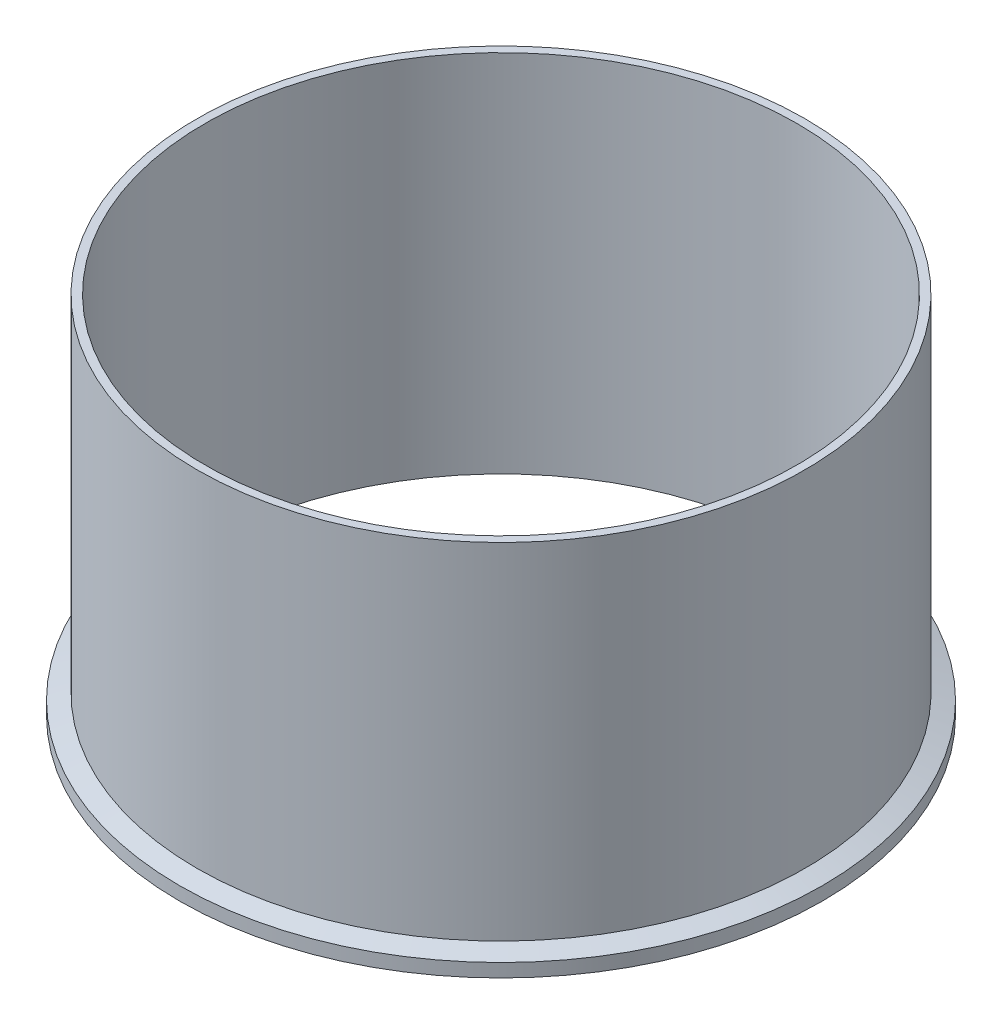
from build123d import *


with BuildPart() as part:
    # Sketch1 → Revolve2 (revolve)
    with BuildSketch(Plane.XY, mode=Mode.PRIVATE) as revolve2_sk:
        with BuildLine():
            Line((-123.5964, 0), (-123.5964, 152.4))
            Line((-123.5964, 152.4), (-127, 152.4))
            Line((-127, 152.4), (-127, 8.222780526))
            Line((-127, 8.222780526), (-134.239, 5.588))
            Line((-134.239, 5.588), (-134.239, 0))
            Line((-134.239, 0), (-130.799208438, 0))
            ThreePointArc((-130.799208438, 0), (-130.367011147, 0.129217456), (-130.076666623, 0.474458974))
            ThreePointArc((-130.076666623, 0.474458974), (-128.9812, 1.1938), (-127.885733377, 0.474458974))
            ThreePointArc((-127.885733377, 0.474458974), (-127.595388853, 0.129217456), (-127.163191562, 0))
            Line((-127.163191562, 0), (-123.5964, 0))
        make_face()
    revolve(revolve2_sk.sketch.rotate(Axis((0, 0, 0), (0, 1, 0)), 270), axis=Axis((0, 0, 0), (0, 1, 0)))


solid = part.part
